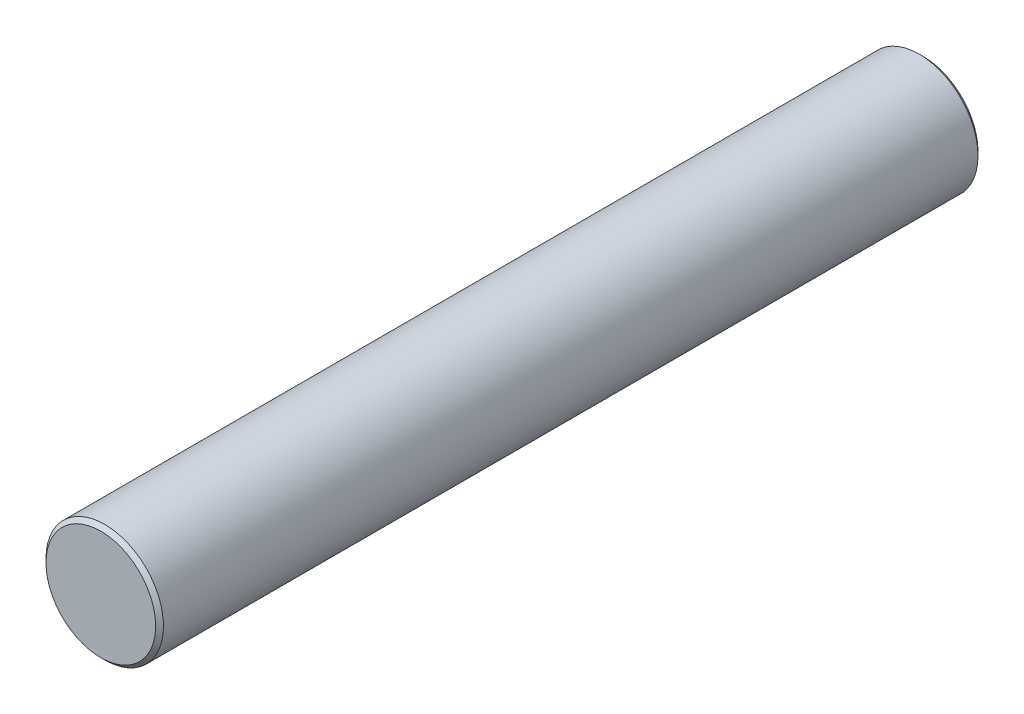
ISO-10303-21;
HEADER;
FILE_DESCRIPTION(('STEP AP214'),'2;1');
FILE_NAME('part.step','',(''),(''),'','','');
FILE_SCHEMA(('AUTOMOTIVE_DESIGN { 1 0 10303 214 1 1 1 1 }'));
ENDSEC;
DATA;
#1=APPLICATION_CONTEXT('core data for automotive mechanical design processes');
#2=APPLICATION_PROTOCOL_DEFINITION('international standard','automotive_design',2000,#1);
#3=PRODUCT_CONTEXT('',#1,'mechanical');
#4=PRODUCT('Part','Part','',(#3));
#5=PRODUCT_RELATED_PRODUCT_CATEGORY('part','',(#4));
#6=PRODUCT_DEFINITION_FORMATION('','',#4);
#7=PRODUCT_DEFINITION_CONTEXT('part definition',#1,'design');
#8=PRODUCT_DEFINITION('design','',#6,#7);
#9=PRODUCT_DEFINITION_SHAPE('','',#8);
#10=(LENGTH_UNIT() NAMED_UNIT(*) SI_UNIT(.MILLI.,.METRE.));
#11=(NAMED_UNIT(*) PLANE_ANGLE_UNIT() SI_UNIT($,.RADIAN.));
#12=(NAMED_UNIT(*) SI_UNIT($,.STERADIAN.) SOLID_ANGLE_UNIT());
#13=UNCERTAINTY_MEASURE_WITH_UNIT(LENGTH_MEASURE(1.E-05),#10,'distance_accuracy_value','');
#14=(GEOMETRIC_REPRESENTATION_CONTEXT(3) GLOBAL_UNCERTAINTY_ASSIGNED_CONTEXT((#13)) GLOBAL_UNIT_ASSIGNED_CONTEXT((#10,
#11,#12)) REPRESENTATION_CONTEXT('',''));
#15=CARTESIAN_POINT('',(0.,0.,0.));
#16=DIRECTION('',(0.,0.,1.));
#17=DIRECTION('',(1.,0.,0.));
#18=AXIS2_PLACEMENT_3D('',#15,#16,#17);
#19=CARTESIAN_POINT('',(0.,0.,21.));
#20=DIRECTION('',(0.,0.,-1.));
#21=DIRECTION('',(-1.,0.,0.));
#22=AXIS2_PLACEMENT_3D('',#19,#20,#21);
#23=CYLINDRICAL_SURFACE('',#22,1.5);
#24=CARTESIAN_POINT('',(0.,0.,0.100000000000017));
#25=DIRECTION('',(0.,0.,1.));
#26=DIRECTION('',(1.,0.,0.));
#27=AXIS2_PLACEMENT_3D('',#24,#25,#26);
#28=CIRCLE('',#27,1.5);
#29=CARTESIAN_POINT('',(-1.5,0.,0.100000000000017));
#30=VERTEX_POINT('',#29);
#31=EDGE_CURVE('E41',#30,#30,#28,.T.);
#32=CARTESIAN_POINT('',(0.,0.,20.9));
#33=DIRECTION('',(0.,0.,1.));
#34=DIRECTION('',(1.,0.,0.));
#35=AXIS2_PLACEMENT_3D('',#32,#33,#34);
#36=CIRCLE('',#35,1.5);
#37=CARTESIAN_POINT('',(-1.5,0.,20.9));
#38=VERTEX_POINT('',#37);
#39=EDGE_CURVE('E45',#38,#38,#36,.F.);
#40=CARTESIAN_POINT('',(-1.5,0.,0.100000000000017));
#41=CARTESIAN_POINT('',(-1.5,0.,0.316666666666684));
#42=CARTESIAN_POINT('',(-1.5,0.,0.533333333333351));
#43=CARTESIAN_POINT('',(-1.5,0.,0.966666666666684));
#44=CARTESIAN_POINT('',(-1.5,0.,1.18333333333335));
#45=CARTESIAN_POINT('',(-1.5,0.,1.61666666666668));
#46=CARTESIAN_POINT('',(-1.5,0.,1.83333333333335));
#47=CARTESIAN_POINT('',(-1.5,0.,2.26666666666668));
#48=CARTESIAN_POINT('',(-1.5,0.,2.48333333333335));
#49=CARTESIAN_POINT('',(-1.5,0.,2.91666666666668));
#50=CARTESIAN_POINT('',(-1.5,0.,3.13333333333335));
#51=CARTESIAN_POINT('',(-1.5,0.,3.56666666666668));
#52=CARTESIAN_POINT('',(-1.5,0.,3.78333333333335));
#53=CARTESIAN_POINT('',(-1.5,0.,4.21666666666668));
#54=CARTESIAN_POINT('',(-1.5,0.,4.43333333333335));
#55=CARTESIAN_POINT('',(-1.5,0.,4.86666666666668));
#56=CARTESIAN_POINT('',(-1.5,0.,5.08333333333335));
#57=CARTESIAN_POINT('',(-1.5,0.,5.51666666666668));
#58=CARTESIAN_POINT('',(-1.5,0.,5.73333333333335));
#59=CARTESIAN_POINT('',(-1.5,0.,6.16666666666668));
#60=CARTESIAN_POINT('',(-1.5,0.,6.38333333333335));
#61=CARTESIAN_POINT('',(-1.5,0.,6.81666666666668));
#62=CARTESIAN_POINT('',(-1.5,0.,7.03333333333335));
#63=CARTESIAN_POINT('',(-1.5,0.,7.46666666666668));
#64=CARTESIAN_POINT('',(-1.5,0.,7.68333333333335));
#65=CARTESIAN_POINT('',(-1.5,0.,8.11666666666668));
#66=CARTESIAN_POINT('',(-1.5,0.,8.33333333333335));
#67=CARTESIAN_POINT('',(-1.5,0.,8.76666666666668));
#68=CARTESIAN_POINT('',(-1.5,0.,8.98333333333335));
#69=CARTESIAN_POINT('',(-1.5,0.,9.41666666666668));
#70=CARTESIAN_POINT('',(-1.5,0.,9.63333333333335));
#71=CARTESIAN_POINT('',(-1.5,0.,10.0666666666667));
#72=CARTESIAN_POINT('',(-1.5,0.,10.2833333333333));
#73=CARTESIAN_POINT('',(-1.5,0.,10.7166666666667));
#74=CARTESIAN_POINT('',(-1.5,0.,10.9333333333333));
#75=CARTESIAN_POINT('',(-1.5,0.,11.3666666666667));
#76=CARTESIAN_POINT('',(-1.5,0.,11.5833333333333));
#77=CARTESIAN_POINT('',(-1.5,0.,12.0166666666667));
#78=CARTESIAN_POINT('',(-1.5,0.,12.2333333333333));
#79=CARTESIAN_POINT('',(-1.5,0.,12.6666666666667));
#80=CARTESIAN_POINT('',(-1.5,0.,12.8833333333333));
#81=CARTESIAN_POINT('',(-1.5,0.,13.3166666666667));
#82=CARTESIAN_POINT('',(-1.5,0.,13.5333333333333));
#83=CARTESIAN_POINT('',(-1.5,0.,13.9666666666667));
#84=CARTESIAN_POINT('',(-1.5,0.,14.1833333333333));
#85=CARTESIAN_POINT('',(-1.5,0.,14.6166666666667));
#86=CARTESIAN_POINT('',(-1.5,0.,14.8333333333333));
#87=CARTESIAN_POINT('',(-1.5,0.,15.2666666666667));
#88=CARTESIAN_POINT('',(-1.5,0.,15.4833333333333));
#89=CARTESIAN_POINT('',(-1.5,0.,15.9166666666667));
#90=CARTESIAN_POINT('',(-1.5,0.,16.1333333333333));
#91=CARTESIAN_POINT('',(-1.5,0.,16.5666666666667));
#92=CARTESIAN_POINT('',(-1.5,0.,16.7833333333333));
#93=CARTESIAN_POINT('',(-1.5,0.,17.2166666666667));
#94=CARTESIAN_POINT('',(-1.5,0.,17.4333333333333));
#95=CARTESIAN_POINT('',(-1.5,0.,17.8666666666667));
#96=CARTESIAN_POINT('',(-1.5,0.,18.0833333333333));
#97=CARTESIAN_POINT('',(-1.5,0.,18.5166666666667));
#98=CARTESIAN_POINT('',(-1.5,0.,18.7333333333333));
#99=CARTESIAN_POINT('',(-1.5,0.,19.1666666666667));
#100=CARTESIAN_POINT('',(-1.5,0.,19.3833333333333));
#101=CARTESIAN_POINT('',(-1.5,0.,19.8166666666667));
#102=CARTESIAN_POINT('',(-1.5,0.,20.0333333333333));
#103=CARTESIAN_POINT('',(-1.5,0.,20.4666666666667));
#104=CARTESIAN_POINT('',(-1.5,0.,20.6833333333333));
#105=CARTESIAN_POINT('',(-1.5,0.,20.9));
#106=B_SPLINE_CURVE_WITH_KNOTS('',3,(#40,#41,#42,#43,#44,#45,#46,#47,#48,#49,#50,#51,#52,#53,
#54,#55,#56,#57,#58,#59,#60,#61,#62,#63,#64,#65,#66,#67,#68,#69,#70,#71,#72,#73,#74,#75,#76,#77,
#78,#79,#80,#81,#82,#83,#84,#85,#86,#87,#88,#89,#90,#91,#92,#93,#94,#95,#96,#97,#98,#99,#100,
#101,#102,#103,#104,#105),.UNSPECIFIED.,.F.,.F.,(4,2,2,2,2,2,2,2,2,2,2,2,2,2,2,2,2,2,2,2,2,2,2,
2,2,2,2,2,2,2,2,2,4),(0.,0.650000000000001,1.3,1.95,2.6,3.25,3.9,4.55,5.2,5.85,6.5,7.15,7.8,
8.45,9.1,9.75,10.4,11.05,11.7,12.35,13.,13.65,14.3,14.95,15.6,16.25,16.9,17.55,18.2,18.85,19.5,
20.15,20.8),.UNSPECIFIED.);
#107=EDGE_CURVE('BSEAM30',#30,#38,#106,.T.);
#108=ORIENTED_EDGE('',*,*,#31,.T.);
#109=ORIENTED_EDGE('',*,*,#39,.T.);
#110=ORIENTED_EDGE('',*,*,#107,.T.);
#111=ORIENTED_EDGE('',*,*,#107,.F.);
#112=EDGE_LOOP('',(#108,#110,#109,#111));
#113=FACE_BOUND('',#112,.T.);
#114=ADVANCED_FACE('F30',(#113),#23,.T.);
#115=CARTESIAN_POINT('',(0.,0.,21.));
#116=DIRECTION('',(0.,0.,1.));
#117=DIRECTION('',(1.,0.,0.));
#118=AXIS2_PLACEMENT_3D('',#115,#116,#117);
#119=PLANE('',#118);
#120=CARTESIAN_POINT('',(0.,0.,21.));
#121=DIRECTION('',(0.,0.,1.));
#122=DIRECTION('',(1.,0.,0.));
#123=AXIS2_PLACEMENT_3D('',#120,#121,#122);
#124=CIRCLE('',#123,1.40000000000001);
#125=CARTESIAN_POINT('',(-1.40000000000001,0.,21.));
#126=VERTEX_POINT('',#125);
#127=EDGE_CURVE('E10',#126,#126,#124,.T.);
#128=ORIENTED_EDGE('',*,*,#127,.T.);
#129=EDGE_LOOP('',(#128));
#130=FACE_BOUND('',#129,.T.);
#131=ADVANCED_FACE('F61',(#130),#119,.T.);
#132=CARTESIAN_POINT('',(0.,0.,0.));
#133=DIRECTION('',(0.,0.,1.));
#134=DIRECTION('',(1.,0.,0.));
#135=AXIS2_PLACEMENT_3D('',#132,#133,#134);
#136=PLANE('',#135);
#137=CARTESIAN_POINT('',(0.,0.,0.));
#138=DIRECTION('',(0.,0.,1.));
#139=DIRECTION('',(1.,0.,0.));
#140=AXIS2_PLACEMENT_3D('',#137,#138,#139);
#141=CIRCLE('',#140,1.39999999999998);
#142=CARTESIAN_POINT('',(1.39999999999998,0.,0.));
#143=VERTEX_POINT('',#142);
#144=EDGE_CURVE('E37',#143,#143,#141,.F.);
#145=ORIENTED_EDGE('',*,*,#144,.T.);
#146=EDGE_LOOP('',(#145));
#147=FACE_BOUND('',#146,.T.);
#148=ADVANCED_FACE('F58',(#147),#136,.F.);
#149=CARTESIAN_POINT('',(0.,0.,0.100000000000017));
#150=DIRECTION('',(0.,0.,1.));
#151=DIRECTION('',(1.,0.,0.));
#152=AXIS2_PLACEMENT_3D('',#149,#150,#151);
#153=CONICAL_SURFACE('',#152,1.5,0.785398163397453);
#154=ORIENTED_EDGE('',*,*,#144,.F.);
#155=EDGE_LOOP('',(#154));
#156=FACE_BOUND('',#155,.T.);
#157=ORIENTED_EDGE('',*,*,#31,.F.);
#158=EDGE_LOOP('',(#157));
#159=FACE_BOUND('',#158,.T.);
#160=ADVANCED_FACE('F54',(#156,#159),#153,.T.);
#161=CARTESIAN_POINT('',(0.,0.,21.));
#162=DIRECTION('',(0.,0.,-1.));
#163=DIRECTION('',(-1.,0.,0.));
#164=AXIS2_PLACEMENT_3D('',#161,#162,#163);
#165=CONICAL_SURFACE('',#164,1.40000000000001,0.785398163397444);
#166=CARTESIAN_POINT('',(-1.5,0.,20.9));
#167=CARTESIAN_POINT('',(-1.49895833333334,0.,20.9010416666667));
#168=CARTESIAN_POINT('',(-1.49791666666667,0.,20.9020833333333));
#169=CARTESIAN_POINT('',(-1.49583333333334,0.,20.9041666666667));
#170=CARTESIAN_POINT('',(-1.49479166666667,0.,20.9052083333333));
#171=CARTESIAN_POINT('',(-1.49270833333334,0.,20.9072916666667));
#172=CARTESIAN_POINT('',(-1.49166666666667,0.,20.9083333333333));
#173=CARTESIAN_POINT('',(-1.48958333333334,0.,20.9104166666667));
#174=CARTESIAN_POINT('',(-1.48854166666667,0.,20.9114583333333));
#175=CARTESIAN_POINT('',(-1.48645833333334,0.,20.9135416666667));
#176=CARTESIAN_POINT('',(-1.48541666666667,0.,20.9145833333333));
#177=CARTESIAN_POINT('',(-1.48333333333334,0.,20.9166666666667));
#178=CARTESIAN_POINT('',(-1.48229166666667,0.,20.9177083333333));
#179=CARTESIAN_POINT('',(-1.48020833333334,0.,20.9197916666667));
#180=CARTESIAN_POINT('',(-1.47916666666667,0.,20.9208333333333));
#181=CARTESIAN_POINT('',(-1.47708333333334,0.,20.9229166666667));
#182=CARTESIAN_POINT('',(-1.47604166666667,0.,20.9239583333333));
#183=CARTESIAN_POINT('',(-1.47395833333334,0.,20.9260416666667));
#184=CARTESIAN_POINT('',(-1.47291666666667,0.,20.9270833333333));
#185=CARTESIAN_POINT('',(-1.47083333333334,0.,20.9291666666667));
#186=CARTESIAN_POINT('',(-1.46979166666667,0.,20.9302083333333));
#187=CARTESIAN_POINT('',(-1.46770833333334,0.,20.9322916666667));
#188=CARTESIAN_POINT('',(-1.46666666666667,0.,20.9333333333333));
#189=CARTESIAN_POINT('',(-1.46458333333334,0.,20.9354166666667));
#190=CARTESIAN_POINT('',(-1.46354166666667,0.,20.9364583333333));
#191=CARTESIAN_POINT('',(-1.46145833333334,0.,20.9385416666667));
#192=CARTESIAN_POINT('',(-1.46041666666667,0.,20.9395833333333));
#193=CARTESIAN_POINT('',(-1.45833333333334,0.,20.9416666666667));
#194=CARTESIAN_POINT('',(-1.45729166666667,0.,20.9427083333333));
#195=CARTESIAN_POINT('',(-1.45520833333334,0.,20.9447916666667));
#196=CARTESIAN_POINT('',(-1.45416666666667,0.,20.9458333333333));
#197=CARTESIAN_POINT('',(-1.45208333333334,0.,20.9479166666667));
#198=CARTESIAN_POINT('',(-1.45104166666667,0.,20.9489583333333));
#199=CARTESIAN_POINT('',(-1.44895833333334,0.,20.9510416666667));
#200=CARTESIAN_POINT('',(-1.44791666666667,0.,20.9520833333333));
#201=CARTESIAN_POINT('',(-1.44583333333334,0.,20.9541666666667));
#202=CARTESIAN_POINT('',(-1.44479166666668,0.,20.9552083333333));
#203=CARTESIAN_POINT('',(-1.44270833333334,0.,20.9572916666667));
#204=CARTESIAN_POINT('',(-1.44166666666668,0.,20.9583333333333));
#205=CARTESIAN_POINT('',(-1.43958333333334,0.,20.9604166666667));
#206=CARTESIAN_POINT('',(-1.43854166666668,0.,20.9614583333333));
#207=CARTESIAN_POINT('',(-1.43645833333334,0.,20.9635416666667));
#208=CARTESIAN_POINT('',(-1.43541666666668,0.,20.9645833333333));
#209=CARTESIAN_POINT('',(-1.43333333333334,0.,20.9666666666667));
#210=CARTESIAN_POINT('',(-1.43229166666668,0.,20.9677083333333));
#211=CARTESIAN_POINT('',(-1.43020833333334,0.,20.9697916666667));
#212=CARTESIAN_POINT('',(-1.42916666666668,0.,20.9708333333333));
#213=CARTESIAN_POINT('',(-1.42708333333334,0.,20.9729166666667));
#214=CARTESIAN_POINT('',(-1.42604166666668,0.,20.9739583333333));
#215=CARTESIAN_POINT('',(-1.42395833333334,0.,20.9760416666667));
#216=CARTESIAN_POINT('',(-1.42291666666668,0.,20.9770833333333));
#217=CARTESIAN_POINT('',(-1.42083333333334,0.,20.9791666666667));
#218=CARTESIAN_POINT('',(-1.41979166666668,0.,20.9802083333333));
#219=CARTESIAN_POINT('',(-1.41770833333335,0.,20.9822916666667));
#220=CARTESIAN_POINT('',(-1.41666666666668,0.,20.9833333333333));
#221=CARTESIAN_POINT('',(-1.41458333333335,0.,20.9854166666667));
#222=CARTESIAN_POINT('',(-1.41354166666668,0.,20.9864583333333));
#223=CARTESIAN_POINT('',(-1.41145833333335,0.,20.9885416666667));
#224=CARTESIAN_POINT('',(-1.41041666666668,0.,20.9895833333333));
#225=CARTESIAN_POINT('',(-1.40833333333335,0.,20.9916666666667));
#226=CARTESIAN_POINT('',(-1.40729166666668,0.,20.9927083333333));
#227=CARTESIAN_POINT('',(-1.40520833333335,0.,20.9947916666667));
#228=CARTESIAN_POINT('',(-1.40416666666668,0.,20.9958333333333));
#229=CARTESIAN_POINT('',(-1.40208333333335,0.,20.9979166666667));
#230=CARTESIAN_POINT('',(-1.40104166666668,0.,20.9989583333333));
#231=CARTESIAN_POINT('',(-1.40000000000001,0.,21.));
#232=B_SPLINE_CURVE_WITH_KNOTS('',3,(#166,#167,#168,#169,#170,#171,#172,#173,#174,#175,#176,
#177,#178,#179,#180,#181,#182,#183,#184,#185,#186,#187,#188,#189,#190,#191,#192,#193,#194,#195,
#196,#197,#198,#199,#200,#201,#202,#203,#204,#205,#206,#207,#208,#209,#210,#211,#212,#213,#214,
#215,#216,#217,#218,#219,#220,#221,#222,#223,#224,#225,#226,#227,#228,#229,#230,#231),
.UNSPECIFIED.,.F.,.F.,(4,2,2,2,2,2,2,2,2,2,2,2,2,2,2,2,2,2,2,2,2,2,2,2,2,2,2,2,2,2,2,2,4),(0.,
0.00441941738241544,0.00883883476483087,0.0132582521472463,0.0176776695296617,0.022097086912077,
0.0265165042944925,0.0309359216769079,0.0353553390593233,0.0397747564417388,0.0441941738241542,
0.0486135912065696,0.0530330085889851,0.0574524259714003,0.0618718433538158,0.0662912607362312,
0.0707106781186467,0.0751300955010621,0.0795495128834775,0.083968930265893,0.0883883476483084,
0.0928077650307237,0.0972271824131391,0.101646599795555,0.10606601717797,0.110485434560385,
0.114904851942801,0.119324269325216,0.123743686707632,0.128163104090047,0.132582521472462,
0.137001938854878,0.141421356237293),.UNSPECIFIED.);
#233=EDGE_CURVE('BSEAM32',#38,#126,#232,.T.);
#234=ORIENTED_EDGE('',*,*,#39,.F.);
#235=ORIENTED_EDGE('',*,*,#127,.F.);
#236=ORIENTED_EDGE('',*,*,#233,.T.);
#237=ORIENTED_EDGE('',*,*,#233,.F.);
#238=EDGE_LOOP('',(#234,#236,#235,#237));
#239=FACE_BOUND('',#238,.T.);
#240=ADVANCED_FACE('F32',(#239),#165,.T.);
#241=CLOSED_SHELL('',(#114,#131,#148,#160,#240));
#242=MANIFOLD_SOLID_BREP('B2',#241);
#243=ADVANCED_BREP_SHAPE_REPRESENTATION('',(#18,#242),#14);
#244=SHAPE_DEFINITION_REPRESENTATION(#9,#243);
ENDSEC;
END-ISO-10303-21;
